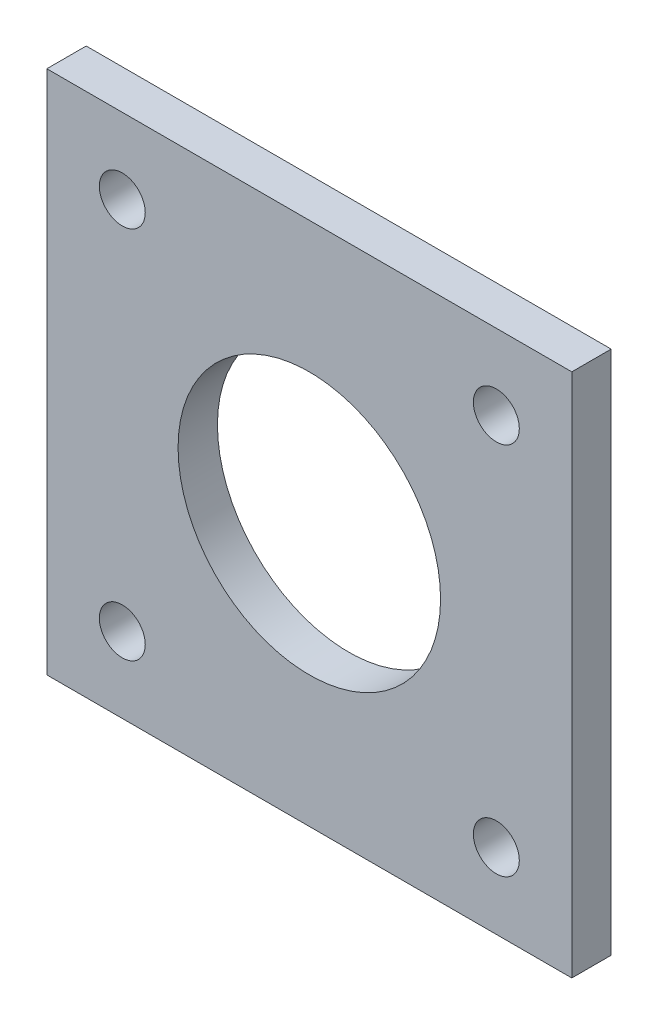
from build123d import *

# Parameters (mm, degrees)
SKETCH_1_W                  = 40
SKETCH_1_H                  = 40
EXTRUDE_1_DEPTH             = 3
HOLE_WIZARD_3_5_3_5_1_D     = 3.5
HOLE_WIZARD_3_5_3_5_1_DEPTH = 5
HOLE_WIZARD_3_5_3_5_1_TIP   = 1.051506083
SKETCH_4_R                  = 10
CUT_EXTRUDE_1_DEPTH         = 3


with BuildPart() as part:
    # Sketch 1 → Extrude 1 (new body)
    with BuildSketch(Plane.XY):
        Rectangle(SKETCH_1_W, SKETCH_1_H)
    extrude(amount=EXTRUDE_1_DEPTH)

    # Hole Wizard 3.5 _3.5_ _1
    with Locations(Plane.XY.offset(3)):
        with Locations((-14.25, 14.25), (14.25, 14.25), (14.25, -14.25), (-14.25, -14.25)):
            Hole(HOLE_WIZARD_3_5_3_5_1_D / 2, depth=HOLE_WIZARD_3_5_3_5_1_DEPTH)
            with Locations((0, 0, -(HOLE_WIZARD_3_5_3_5_1_DEPTH + HOLE_WIZARD_3_5_3_5_1_TIP / 2))):  # 118° drill point
                Cone(0, HOLE_WIZARD_3_5_3_5_1_D / 2, HOLE_WIZARD_3_5_3_5_1_TIP, mode=Mode.SUBTRACT)

    # Sketch 4 → Cut-Extrude 1 (cut)
    with BuildSketch(Plane.XY.offset(3)):
        Circle(SKETCH_4_R)
    extrude(amount=-CUT_EXTRUDE_1_DEPTH, mode=Mode.SUBTRACT)


solid = part.part
